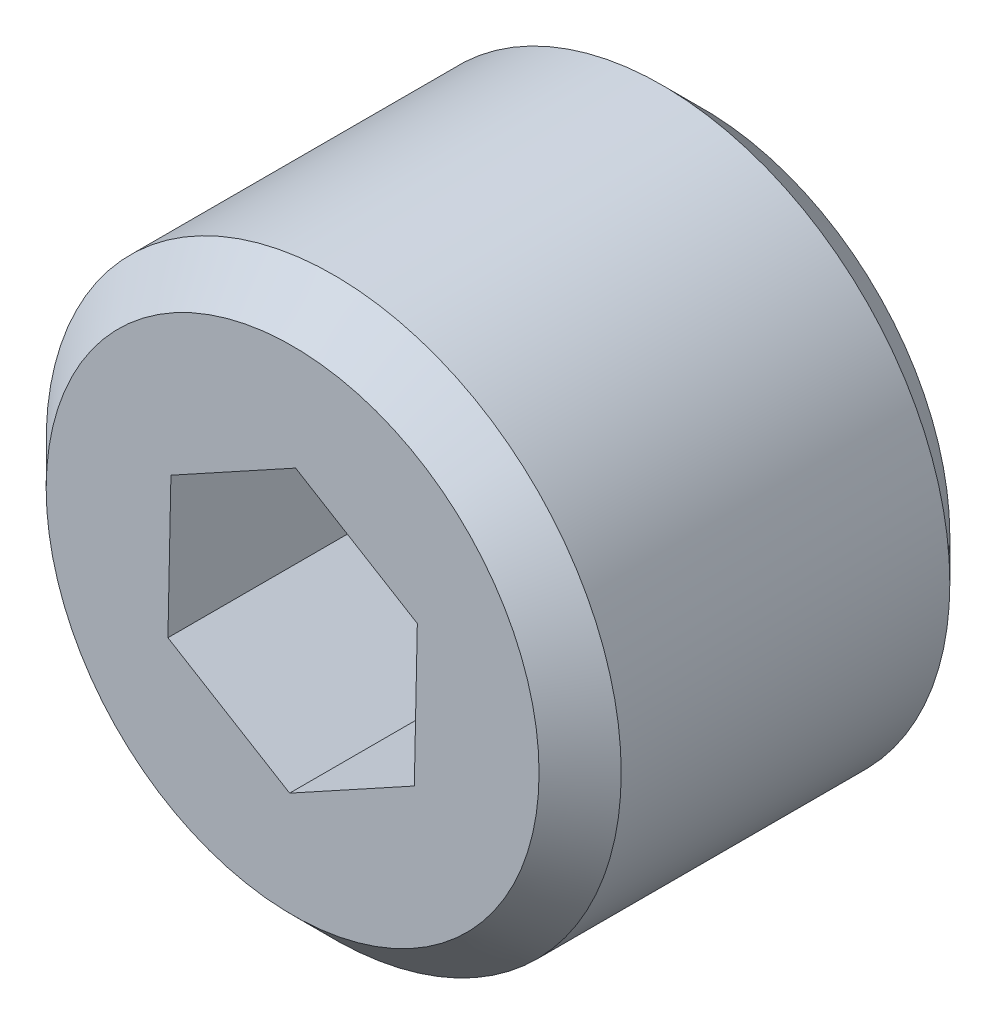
from build123d import *

# Parameters (mm, degrees)
CROQUIS1_R              = 7
SALIENTE_EXTRUIR1_DEPTH = 10
CORTAR_EXTRUIR1_DEPTH   = 5
CHAFL_N1_SIZE           = 1


with BuildPart() as part:
    # Croquis1 → Saliente-Extruir1 (new body)
    with BuildSketch(Plane.XY):
        Circle(CROQUIS1_R)
    extrude(amount=SALIENTE_EXTRUIR1_DEPTH)

    # Croquis2 → Cortar-Extruir1 (cut)
    with BuildSketch(Plane.XY.offset(10)):
        Polygon((-2.962761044, 1.795006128), (-3.035901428, -1.668323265), (-0.073140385, -3.463329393), (2.962761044, -1.795006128), (3.035901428, 1.668323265), (0.073140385, 3.463329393), align=None)
    extrude(amount=-CORTAR_EXTRUIR1_DEPTH, mode=Mode.SUBTRACT)

    # Chafl_n1
    chafl_n1_edges = [part.edges().sort_by_distance(p)[0] for p in [
        (-7, 0, 0),
        (-7, 0, 10),
    ]]
    chamfer(chafl_n1_edges, length=CHAFL_N1_SIZE)


solid = part.part
